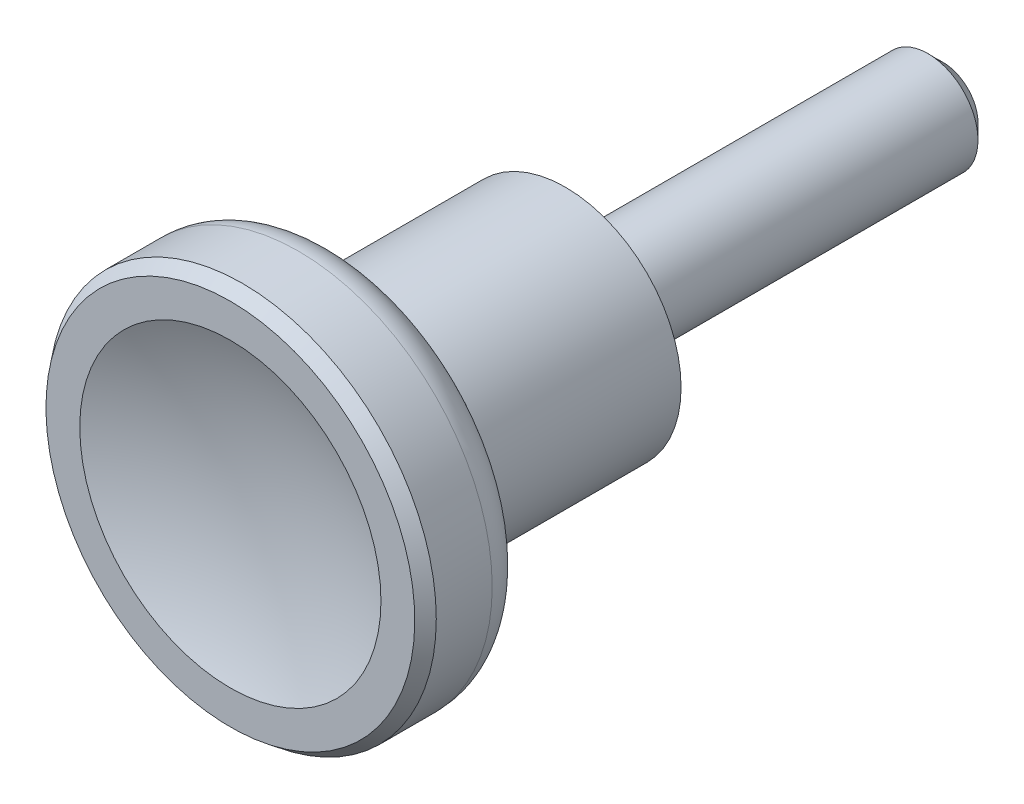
ISO-10303-21;
HEADER;
FILE_DESCRIPTION(('STEP AP214'),'2;1');
FILE_NAME('part.step','',(''),(''),'','','');
FILE_SCHEMA(('AUTOMOTIVE_DESIGN { 1 0 10303 214 1 1 1 1 }'));
ENDSEC;
DATA;
#1=APPLICATION_CONTEXT('core data for automotive mechanical design processes');
#2=APPLICATION_PROTOCOL_DEFINITION('international standard','automotive_design',2000,#1);
#3=PRODUCT_CONTEXT('',#1,'mechanical');
#4=PRODUCT('Part','Part','',(#3));
#5=PRODUCT_RELATED_PRODUCT_CATEGORY('part','',(#4));
#6=PRODUCT_DEFINITION_FORMATION('','',#4);
#7=PRODUCT_DEFINITION_CONTEXT('part definition',#1,'design');
#8=PRODUCT_DEFINITION('design','',#6,#7);
#9=PRODUCT_DEFINITION_SHAPE('','',#8);
#10=(LENGTH_UNIT() NAMED_UNIT(*) SI_UNIT(.MILLI.,.METRE.));
#11=(NAMED_UNIT(*) PLANE_ANGLE_UNIT() SI_UNIT($,.RADIAN.));
#12=(NAMED_UNIT(*) SI_UNIT($,.STERADIAN.) SOLID_ANGLE_UNIT());
#13=UNCERTAINTY_MEASURE_WITH_UNIT(LENGTH_MEASURE(1.E-05),#10,'distance_accuracy_value','');
#14=(GEOMETRIC_REPRESENTATION_CONTEXT(3) GLOBAL_UNCERTAINTY_ASSIGNED_CONTEXT((#13)) GLOBAL_UNIT_ASSIGNED_CONTEXT((#10,
#11,#12)) REPRESENTATION_CONTEXT('',''));
#15=CARTESIAN_POINT('',(0.,0.,0.));
#16=DIRECTION('',(0.,0.,1.));
#17=DIRECTION('',(1.,0.,0.));
#18=AXIS2_PLACEMENT_3D('',#15,#16,#17);
#19=CARTESIAN_POINT('',(9.25,0.,0.2));
#20=DIRECTION('',(0.,0.,1.));
#21=DIRECTION('',(0.,-1.,0.));
#22=AXIS2_PLACEMENT_3D('',#19,#20,#21);
#23=PLANE('',#22);
#24=CARTESIAN_POINT('',(0.,0.,0.2));
#25=DIRECTION('',(0.,0.,-1.));
#26=DIRECTION('',(0.,1.,0.));
#27=AXIS2_PLACEMENT_3D('',#24,#25,#26);
#28=CIRCLE('',#27,5.);
#29=CARTESIAN_POINT('',(0.,5.,0.2));
#30=VERTEX_POINT('',#29);
#31=EDGE_CURVE('E56',#30,#30,#28,.T.);
#32=ORIENTED_EDGE('',*,*,#31,.F.);
#33=EDGE_LOOP('',(#32));
#34=FACE_BOUND('',#33,.T.);
#35=CARTESIAN_POINT('',(0.,0.,0.2));
#36=DIRECTION('',(0.,0.,-1.));
#37=DIRECTION('',(0.,1.,0.));
#38=AXIS2_PLACEMENT_3D('',#35,#36,#37);
#39=CIRCLE('',#38,9.25);
#40=CARTESIAN_POINT('',(0.,9.25,0.2));
#41=VERTEX_POINT('',#40);
#42=EDGE_CURVE('E23',#41,#41,#39,.T.);
#43=ORIENTED_EDGE('',*,*,#42,.T.);
#44=EDGE_LOOP('',(#43));
#45=FACE_BOUND('',#44,.T.);
#46=ADVANCED_FACE('F12',(#34,#45),#23,.F.);
#47=CARTESIAN_POINT('',(0.,0.,-4.9324732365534));
#48=DIRECTION('',(0.,0.,-1.));
#49=DIRECTION('',(0.,1.,0.));
#50=AXIS2_PLACEMENT_3D('',#47,#48,#49);
#51=CYLINDRICAL_SURFACE('',#50,9.25);
#52=CARTESIAN_POINT('',(0.,0.,17.));
#53=DIRECTION('',(0.,0.,-1.));
#54=DIRECTION('',(0.,1.,0.));
#55=AXIS2_PLACEMENT_3D('',#52,#53,#54);
#56=CIRCLE('',#55,9.25);
#57=CARTESIAN_POINT('',(0.,9.25,17.));
#58=VERTEX_POINT('',#57);
#59=EDGE_CURVE('E27',#58,#58,#56,.T.);
#60=ORIENTED_EDGE('',*,*,#59,.T.);
#61=EDGE_LOOP('',(#60));
#62=FACE_BOUND('',#61,.T.);
#63=ORIENTED_EDGE('',*,*,#42,.F.);
#64=EDGE_LOOP('',(#63));
#65=FACE_BOUND('',#64,.T.);
#66=ADVANCED_FACE('F64',(#62,#65),#51,.T.);
#67=CARTESIAN_POINT('',(0.,0.,17.));
#68=DIRECTION('',(0.,0.,-1.));
#69=DIRECTION('',(0.,1.,0.));
#70=AXIS2_PLACEMENT_3D('',#67,#68,#69);
#71=TOROIDAL_SURFACE('',#70,10.0070026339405,0.757002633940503);
#72=ORIENTED_EDGE('',*,*,#59,.F.);
#73=EDGE_LOOP('',(#72));
#74=FACE_BOUND('',#73,.T.);
#75=CARTESIAN_POINT('',(0.,0.,17.7312080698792));
#76=DIRECTION('',(0.,0.,-1.));
#77=DIRECTION('',(0.,1.,0.));
#78=AXIS2_PLACEMENT_3D('',#75,#76,#77);
#79=CIRCLE('',#78,9.81107472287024);
#80=CARTESIAN_POINT('',(0.,9.81107472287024,17.7312080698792));
#81=VERTEX_POINT('',#80);
#82=EDGE_CURVE('E32',#81,#81,#79,.T.);
#83=ORIENTED_EDGE('',*,*,#82,.T.);
#84=EDGE_LOOP('',(#83));
#85=FACE_BOUND('',#84,.T.);
#86=ADVANCED_FACE('F68',(#74,#85),#71,.F.);
#87=CARTESIAN_POINT('',(0.,0.,17.7312080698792));
#88=DIRECTION('',(0.,0.,1.));
#89=DIRECTION('',(0.,-1.,0.));
#90=AXIS2_PLACEMENT_3D('',#87,#88,#89);
#91=CONICAL_SURFACE('',#90,9.81107472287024,1.30899528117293);
#92=CARTESIAN_POINT('',(0.,0.,18.6597619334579));
#93=DIRECTION('',(0.,0.,-1.));
#94=DIRECTION('',(0.,1.,0.));
#95=AXIS2_PLACEMENT_3D('',#92,#93,#94);
#96=CIRCLE('',#95,13.2764619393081);
#97=CARTESIAN_POINT('',(0.,13.2764619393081,18.6597619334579));
#98=VERTEX_POINT('',#97);
#99=EDGE_CURVE('E35',#98,#98,#96,.T.);
#100=ORIENTED_EDGE('',*,*,#99,.T.);
#101=EDGE_LOOP('',(#100));
#102=FACE_BOUND('',#101,.T.);
#103=ORIENTED_EDGE('',*,*,#82,.F.);
#104=EDGE_LOOP('',(#103));
#105=FACE_BOUND('',#104,.T.);
#106=ADVANCED_FACE('F76',(#102,#105),#91,.T.);
#107=CARTESIAN_POINT('',(0.,0.,21.5575381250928));
#108=DIRECTION('',(0.,0.,-1.));
#109=DIRECTION('',(0.,1.,0.));
#110=AXIS2_PLACEMENT_3D('',#107,#108,#109);
#111=TOROIDAL_SURFACE('',#110,12.5,3.);
#112=CARTESIAN_POINT('',(0.,0.,21.5575381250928));
#113=DIRECTION('',(0.,0.,-1.));
#114=DIRECTION('',(0.,1.,0.));
#115=AXIS2_PLACEMENT_3D('',#112,#113,#114);
#116=CIRCLE('',#115,15.5);
#117=CARTESIAN_POINT('',(0.,15.5,21.5575381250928));
#118=VERTEX_POINT('',#117);
#119=EDGE_CURVE('E38',#118,#118,#116,.T.);
#120=ORIENTED_EDGE('',*,*,#119,.T.);
#121=EDGE_LOOP('',(#120));
#122=FACE_BOUND('',#121,.T.);
#123=ORIENTED_EDGE('',*,*,#99,.F.);
#124=EDGE_LOOP('',(#123));
#125=FACE_BOUND('',#124,.T.);
#126=ADVANCED_FACE('F82',(#122,#125),#111,.T.);
#127=CARTESIAN_POINT('',(0.,0.,-4.9324732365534));
#128=DIRECTION('',(0.,0.,-1.));
#129=DIRECTION('',(0.,1.,0.));
#130=AXIS2_PLACEMENT_3D('',#127,#128,#129);
#131=CYLINDRICAL_SURFACE('',#130,15.5);
#132=CARTESIAN_POINT('',(0.,0.,26.0301314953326));
#133=DIRECTION('',(0.,0.,-1.));
#134=DIRECTION('',(0.,1.,0.));
#135=AXIS2_PLACEMENT_3D('',#132,#133,#134);
#136=CIRCLE('',#135,15.5);
#137=CARTESIAN_POINT('',(0.,15.5,26.0301314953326));
#138=VERTEX_POINT('',#137);
#139=EDGE_CURVE('E41',#138,#138,#136,.T.);
#140=ORIENTED_EDGE('',*,*,#139,.T.);
#141=EDGE_LOOP('',(#140));
#142=FACE_BOUND('',#141,.T.);
#143=ORIENTED_EDGE('',*,*,#119,.F.);
#144=EDGE_LOOP('',(#143));
#145=FACE_BOUND('',#144,.T.);
#146=ADVANCED_FACE('F86',(#142,#145),#131,.T.);
#147=CARTESIAN_POINT('',(0.,0.,27.));
#148=DIRECTION('',(0.,0.,-1.));
#149=DIRECTION('',(0.,1.,0.));
#150=AXIS2_PLACEMENT_3D('',#147,#148,#149);
#151=CONICAL_SURFACE('',#150,14.7507565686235,0.657759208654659);
#152=ORIENTED_EDGE('',*,*,#139,.F.);
#153=EDGE_LOOP('',(#152));
#154=FACE_BOUND('',#153,.T.);
#155=CARTESIAN_POINT('',(0.,0.,27.));
#156=DIRECTION('',(0.,0.,-1.));
#157=DIRECTION('',(0.,1.,0.));
#158=AXIS2_PLACEMENT_3D('',#155,#156,#157);
#159=CIRCLE('',#158,14.7507565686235);
#160=CARTESIAN_POINT('',(0.,14.7507565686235,27.));
#161=VERTEX_POINT('',#160);
#162=EDGE_CURVE('E44',#161,#161,#159,.T.);
#163=ORIENTED_EDGE('',*,*,#162,.T.);
#164=EDGE_LOOP('',(#163));
#165=FACE_BOUND('',#164,.T.);
#166=ADVANCED_FACE('F90',(#154,#165),#151,.T.);
#167=CARTESIAN_POINT('',(14.7507565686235,0.,27.));
#168=DIRECTION('',(0.,0.,1.));
#169=DIRECTION('',(0.,-1.,0.));
#170=AXIS2_PLACEMENT_3D('',#167,#168,#169);
#171=PLANE('',#170);
#172=CARTESIAN_POINT('',(0.,0.,27.));
#173=DIRECTION('',(0.,0.,-1.));
#174=DIRECTION('',(0.,1.,0.));
#175=AXIS2_PLACEMENT_3D('',#172,#173,#174);
#176=CIRCLE('',#175,12.0457822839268);
#177=CARTESIAN_POINT('',(0.,12.0457822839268,27.));
#178=VERTEX_POINT('',#177);
#179=EDGE_CURVE('E47',#178,#178,#176,.T.);
#180=ORIENTED_EDGE('',*,*,#179,.T.);
#181=EDGE_LOOP('',(#180));
#182=FACE_BOUND('',#181,.T.);
#183=ORIENTED_EDGE('',*,*,#162,.F.);
#184=EDGE_LOOP('',(#183));
#185=FACE_BOUND('',#184,.T.);
#186=ADVANCED_FACE('F94',(#182,#185),#171,.T.);
#187=CARTESIAN_POINT('',(0.,0.,54.5624551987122));
#188=DIRECTION('',(0.,-1.,0.));
#189=DIRECTION('',(1.,0.,0.));
#190=AXIS2_PLACEMENT_3D('',#187,#188,#189);
#191=SPHERICAL_SURFACE('',#190,30.0797241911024);
#192=CARTESIAN_POINT('',(0.,0.,54.5624551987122));
#193=DIRECTION('',(0.,0.,-1.));
#194=DIRECTION('',(0.,1.,0.));
#195=AXIS2_PLACEMENT_3D('',#192,#193,#194);
#196=SPHERICAL_SURFACE('',#195,30.0797241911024);
#197=ORIENTED_EDGE('',*,*,#179,.F.);
#198=EDGE_LOOP('',(#197));
#199=FACE_BOUND('',#198,.T.);
#200=ADVANCED_FACE('F98',(#199),#196,.F.);
#201=CARTESIAN_POINT('',(4.,0.,-30.));
#202=DIRECTION('',(0.,0.,1.));
#203=DIRECTION('',(0.,-1.,0.));
#204=AXIS2_PLACEMENT_3D('',#201,#202,#203);
#205=PLANE('',#204);
#206=CARTESIAN_POINT('',(0.,0.,-30.));
#207=DIRECTION('',(0.,0.,1.));
#208=DIRECTION('',(1.,0.,0.));
#209=AXIS2_PLACEMENT_3D('',#206,#207,#208);
#210=CIRCLE('',#209,2.8);
#211=CARTESIAN_POINT('',(2.8,0.,-30.));
#212=VERTEX_POINT('',#211);
#213=EDGE_CURVE('E19',#212,#212,#210,.F.);
#214=ORIENTED_EDGE('',*,*,#213,.T.);
#215=EDGE_LOOP('',(#214));
#216=FACE_BOUND('',#215,.T.);
#217=ADVANCED_FACE('F102',(#216),#205,.F.);
#218=CARTESIAN_POINT('',(0.,0.,-4.9324732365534));
#219=DIRECTION('',(0.,0.,-1.));
#220=DIRECTION('',(0.,1.,0.));
#221=AXIS2_PLACEMENT_3D('',#218,#219,#220);
#222=CYLINDRICAL_SURFACE('',#221,4.);
#223=CARTESIAN_POINT('',(0.,0.,-28.8));
#224=DIRECTION('',(0.,0.,1.));
#225=DIRECTION('',(1.,0.,0.));
#226=AXIS2_PLACEMENT_3D('',#223,#224,#225);
#227=CIRCLE('',#226,4.);
#228=CARTESIAN_POINT('',(4.,0.,-28.8));
#229=VERTEX_POINT('',#228);
#230=EDGE_CURVE('E8',#229,#229,#227,.T.);
#231=ORIENTED_EDGE('',*,*,#230,.T.);
#232=EDGE_LOOP('',(#231));
#233=FACE_BOUND('',#232,.T.);
#234=CARTESIAN_POINT('',(0.,0.,0.));
#235=DIRECTION('',(0.,0.,-1.));
#236=DIRECTION('',(0.,1.,0.));
#237=AXIS2_PLACEMENT_3D('',#234,#235,#236);
#238=CIRCLE('',#237,4.);
#239=CARTESIAN_POINT('',(0.,4.,0.));
#240=VERTEX_POINT('',#239);
#241=EDGE_CURVE('E50',#240,#240,#238,.T.);
#242=ORIENTED_EDGE('',*,*,#241,.T.);
#243=EDGE_LOOP('',(#242));
#244=FACE_BOUND('',#243,.T.);
#245=ADVANCED_FACE('F106',(#233,#244),#222,.T.);
#246=CARTESIAN_POINT('',(4.99999999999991,0.,0.));
#247=DIRECTION('',(0.,0.,1.));
#248=DIRECTION('',(0.,-1.,0.));
#249=AXIS2_PLACEMENT_3D('',#246,#247,#248);
#250=PLANE('',#249);
#251=ORIENTED_EDGE('',*,*,#241,.F.);
#252=EDGE_LOOP('',(#251));
#253=FACE_BOUND('',#252,.T.);
#254=CARTESIAN_POINT('',(0.,0.,0.));
#255=DIRECTION('',(0.,0.,-1.));
#256=DIRECTION('',(0.,1.,0.));
#257=AXIS2_PLACEMENT_3D('',#254,#255,#256);
#258=CIRCLE('',#257,5.);
#259=CARTESIAN_POINT('',(0.,5.,0.));
#260=VERTEX_POINT('',#259);
#261=EDGE_CURVE('E53',#260,#260,#258,.T.);
#262=ORIENTED_EDGE('',*,*,#261,.T.);
#263=EDGE_LOOP('',(#262));
#264=FACE_BOUND('',#263,.T.);
#265=ADVANCED_FACE('F109',(#253,#264),#250,.F.);
#266=CARTESIAN_POINT('',(0.,0.,-4.9324732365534));
#267=DIRECTION('',(0.,0.,-1.));
#268=DIRECTION('',(0.,1.,0.));
#269=AXIS2_PLACEMENT_3D('',#266,#267,#268);
#270=CYLINDRICAL_SURFACE('',#269,5.);
#271=ORIENTED_EDGE('',*,*,#261,.F.);
#272=EDGE_LOOP('',(#271));
#273=FACE_BOUND('',#272,.T.);
#274=ORIENTED_EDGE('',*,*,#31,.T.);
#275=EDGE_LOOP('',(#274));
#276=FACE_BOUND('',#275,.T.);
#277=ADVANCED_FACE('F60',(#273,#276),#270,.T.);
#278=CARTESIAN_POINT('',(0.,0.,-30.));
#279=DIRECTION('',(0.,0.,1.));
#280=DIRECTION('',(1.,0.,0.));
#281=AXIS2_PLACEMENT_3D('',#278,#279,#280);
#282=CONICAL_SURFACE('',#281,2.8,0.785398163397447);
#283=ORIENTED_EDGE('',*,*,#230,.F.);
#284=EDGE_LOOP('',(#283));
#285=FACE_BOUND('',#284,.T.);
#286=ORIENTED_EDGE('',*,*,#213,.F.);
#287=EDGE_LOOP('',(#286));
#288=FACE_BOUND('',#287,.T.);
#289=ADVANCED_FACE('F14',(#285,#288),#282,.T.);
#290=CLOSED_SHELL('',(#46,#66,#86,#106,#126,#146,#166,#186,#200,#217,#245,#265,#277,#289));
#291=MANIFOLD_SOLID_BREP('B1',#290);
#292=ADVANCED_BREP_SHAPE_REPRESENTATION('',(#18,#291),#14);
#293=SHAPE_DEFINITION_REPRESENTATION(#9,#292);
ENDSEC;
END-ISO-10303-21;
